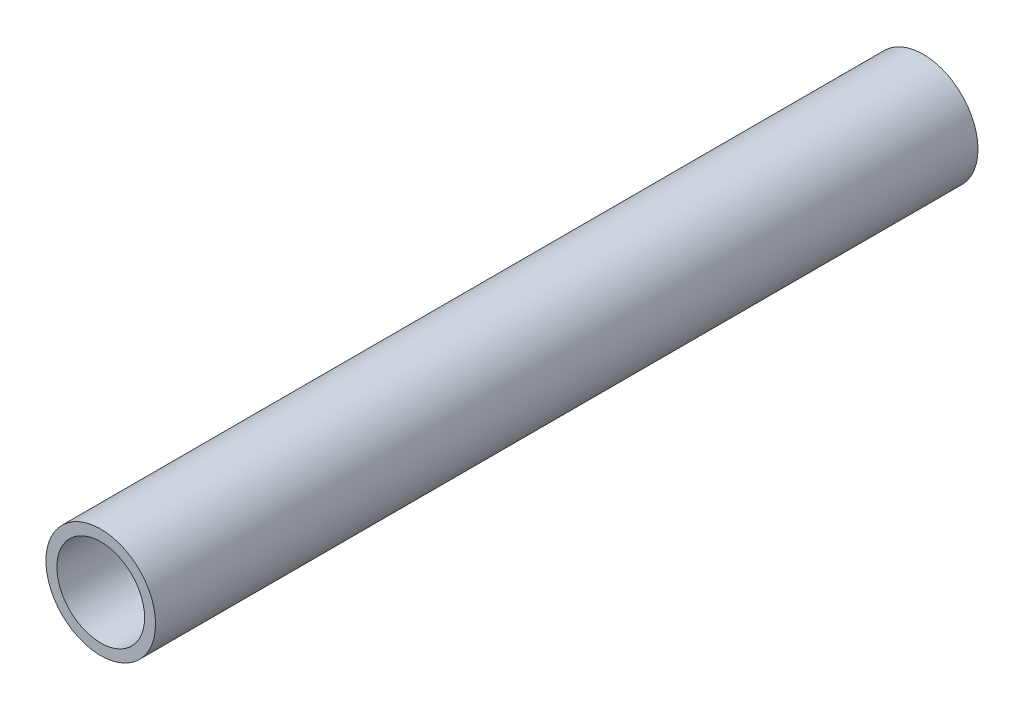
from build123d import *

# Parameters (mm, degrees)
ESQUISSE1_R          = 10
ESQUISSE1_R_2        = 8
BASE_EXTRUSION_DEPTH = 150


with BuildPart() as part:
    # Esquisse1 → Base-Extrusion (new body)
    with BuildSketch(Plane.XY):
        Circle(ESQUISSE1_R)
        Circle(ESQUISSE1_R_2, mode=Mode.SUBTRACT)
    extrude(amount=BASE_EXTRUSION_DEPTH)


solid = part.part
